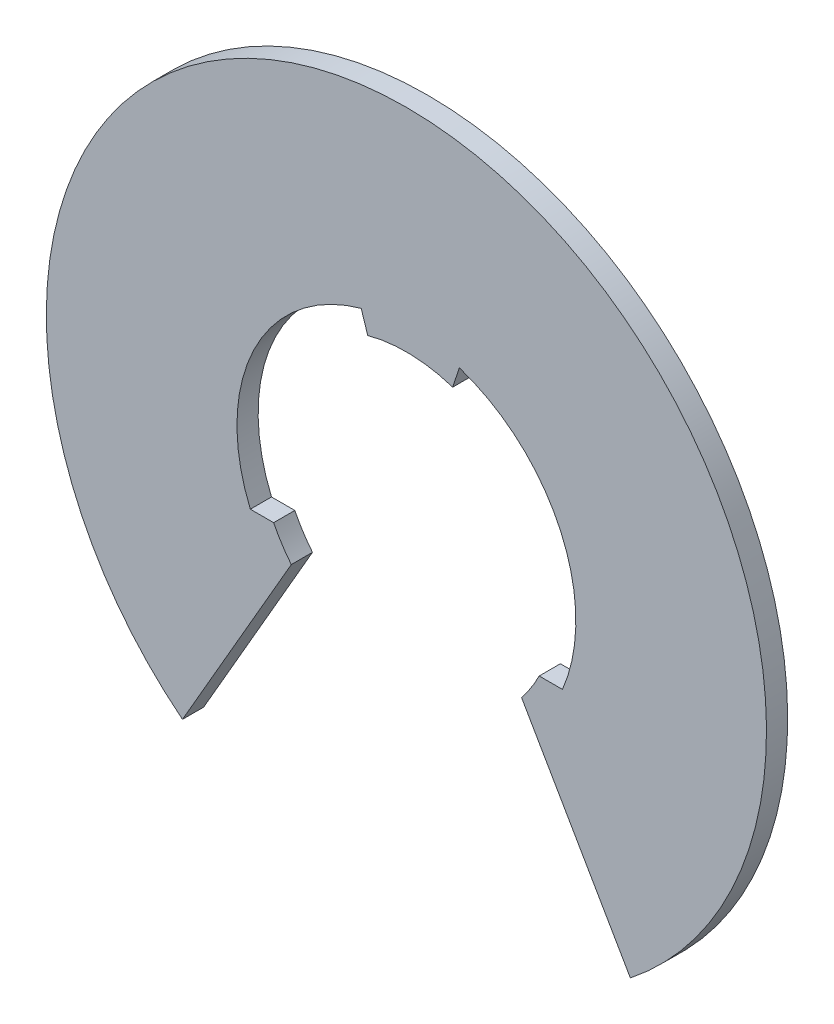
from build123d import *

# Parameters (mm, degrees)
BOSS_EXTRU_1_DEPTH = 0.2


with BuildPart() as part:
    # Esquisse1 → Boss.-Extru.1 (new body)
    with BuildSketch(Plane.XY):
        with BuildLine():
            Line((-1.086854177, -0.882466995), (-1.190777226, -1.062466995))
            Line((-1.190777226, -1.062466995), (-2.114537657, -2.662466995))
            ThreePointArc((-2.114537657, -2.662466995), (0, 3.4), (2.114537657, -2.662466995))
            Line((2.114537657, -2.662466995), (1.190777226, -1.062466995))
            Line((1.190777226, -1.062466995), (1.086854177, -0.882466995))
            ThreePointArc((1.086854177, -0.882466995), (1.177402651, -0.757445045), (1.253636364, -0.623214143))
            Line((1.253636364, -0.623214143), (1.473636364, -0.623214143))
            ThreePointArc((1.473636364, -0.623214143), (1.456625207, 0.661999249), (0.49959984, 1.52))
            Line((0.49959984, 1.52), (0.43714986, 1.33))
            ThreePointArc((0.43714986, 1.33), (0.037688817, 1.399492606), (-0.36493344, 1.351600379))
            Line((-0.36493344, 1.351600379), (-0.426805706, 1.542023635))
            ThreePointArc((-0.426805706, 1.542023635), (-1.440480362, 0.696431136), (-1.473636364, -0.623214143))
            Line((-1.473636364, -0.623214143), (-1.253636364, -0.623214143))
            ThreePointArc((-1.253636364, -0.623214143), (-1.177402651, -0.757445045), (-1.086854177, -0.882466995))
        make_face()
    extrude(amount=BOSS_EXTRU_1_DEPTH)


solid = part.part
